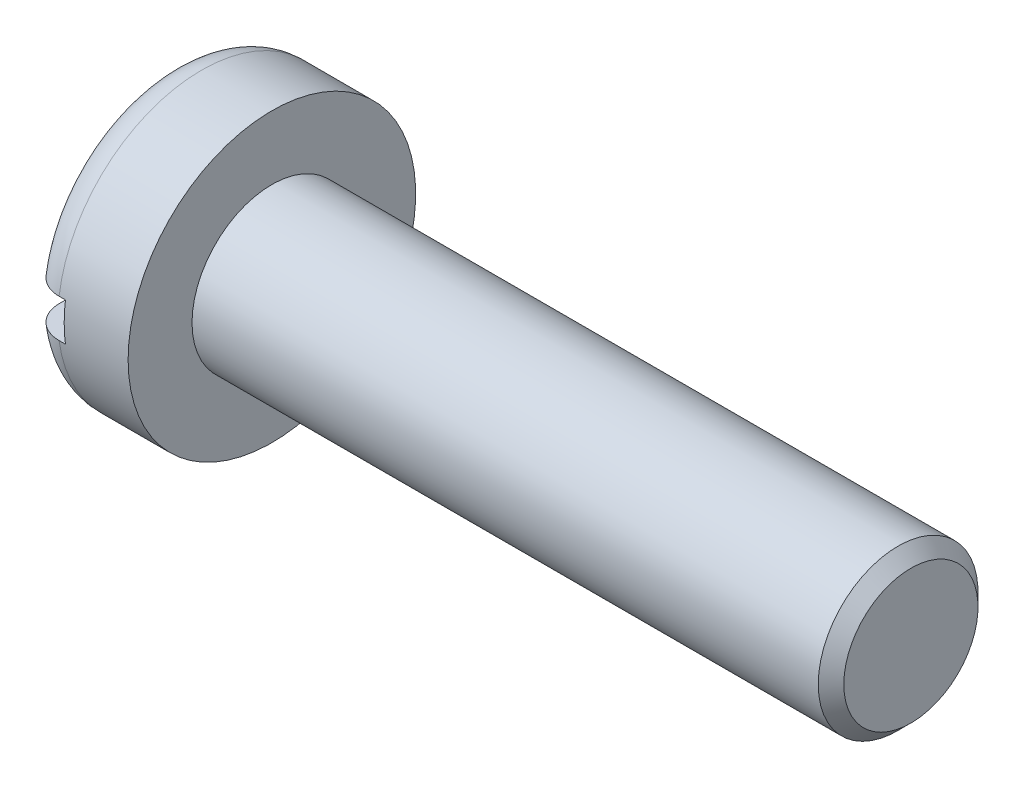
from build123d import *

# Parameters (mm, degrees)
CHANFREIN1_SIZE         = 0.2
CONG_1_R                = 0.5
ESQUISSE3_W             = 0.767853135
ESQUISSE3_H             = 0.6
ENL_V_MAT_EXTRU_1_DEPTH = 5


with BuildPart() as part:
    # Esquisse1 → Base-R_volution (revolve)
    with BuildSketch(Plane.XY, mode=Mode.PRIVATE) as base_r_volution_sk:
        Polygon((-1.6, 0), (-1.6, 2.25), (0, 2.25), (0, 1.25), (10, 1.25), (10, 0), align=None)
    revolve(base_r_volution_sk.sketch.rotate(Axis((-28.982684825, 0, 0), (1, 0, 0)), 90), axis=Axis((-28.982684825, 0, 0), (1, 0, 0)))

    # Chanfrein1
    chanfrein1_edges = [part.edges().sort_by_distance(p)[0] for p in [
        (10, 0, -1.25),
    ]]
    chamfer(chanfrein1_edges, length=CHANFREIN1_SIZE)

    # Cong_1
    cong_1_edges = [part.edges().sort_by_distance(p)[0] for p in [
        (-1.6, 0, -2.25),
    ]]
    fillet(cong_1_edges, radius=CONG_1_R)

    # Esquisse3 → Enl_v. mat.-Extru.1 (cut, symmetric)
    with BuildSketch(Plane.XY):
        with Locations((-1.383926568, 0)):
            Rectangle(ESQUISSE3_W, ESQUISSE3_H)
    extrude(amount=ENL_V_MAT_EXTRU_1_DEPTH, both=True, mode=Mode.SUBTRACT)


solid = part.part
